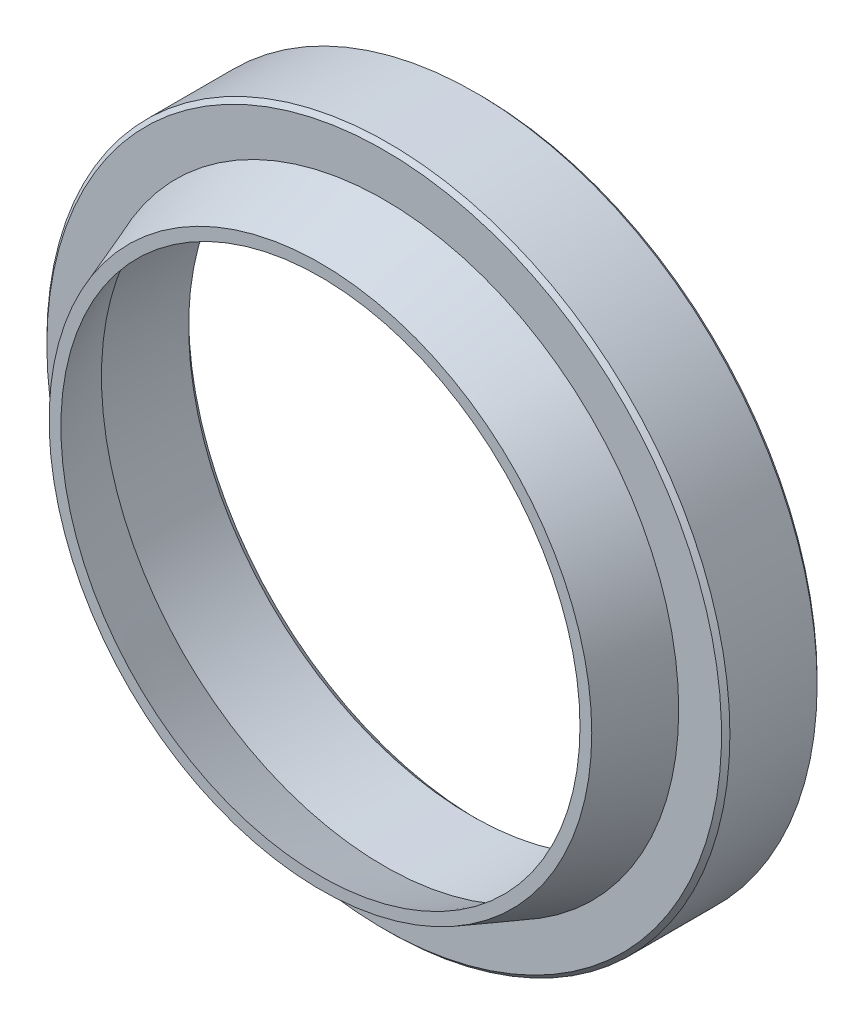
ISO-10303-21;
HEADER;
FILE_DESCRIPTION(('STEP AP214'),'2;1');
FILE_NAME('part.step','',(''),(''),'','','');
FILE_SCHEMA(('AUTOMOTIVE_DESIGN { 1 0 10303 214 1 1 1 1 }'));
ENDSEC;
DATA;
#1=APPLICATION_CONTEXT('core data for automotive mechanical design processes');
#2=APPLICATION_PROTOCOL_DEFINITION('international standard','automotive_design',2000,#1);
#3=PRODUCT_CONTEXT('',#1,'mechanical');
#4=PRODUCT('Part','Part','',(#3));
#5=PRODUCT_RELATED_PRODUCT_CATEGORY('part','',(#4));
#6=PRODUCT_DEFINITION_FORMATION('','',#4);
#7=PRODUCT_DEFINITION_CONTEXT('part definition',#1,'design');
#8=PRODUCT_DEFINITION('design','',#6,#7);
#9=PRODUCT_DEFINITION_SHAPE('','',#8);
#10=(LENGTH_UNIT() NAMED_UNIT(*) SI_UNIT(.MILLI.,.METRE.));
#11=(NAMED_UNIT(*) PLANE_ANGLE_UNIT() SI_UNIT($,.RADIAN.));
#12=(NAMED_UNIT(*) SI_UNIT($,.STERADIAN.) SOLID_ANGLE_UNIT());
#13=UNCERTAINTY_MEASURE_WITH_UNIT(LENGTH_MEASURE(1.E-05),#10,'distance_accuracy_value','');
#14=(GEOMETRIC_REPRESENTATION_CONTEXT(3) GLOBAL_UNCERTAINTY_ASSIGNED_CONTEXT((#13)) GLOBAL_UNIT_ASSIGNED_CONTEXT((#10,
#11,#12)) REPRESENTATION_CONTEXT('',''));
#15=CARTESIAN_POINT('',(0.,0.,0.));
#16=DIRECTION('',(0.,0.,1.));
#17=DIRECTION('',(1.,0.,0.));
#18=AXIS2_PLACEMENT_3D('',#15,#16,#17);
#19=CARTESIAN_POINT('',(-20.7,0.,-11.6666666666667));
#20=DIRECTION('',(0.,0.,1.));
#21=DIRECTION('',(1.,0.,0.));
#22=AXIS2_PLACEMENT_3D('',#19,#20,#21);
#23=PLANE('',#22);
#24=CARTESIAN_POINT('',(0.,0.,-11.6666666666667));
#25=DIRECTION('',(0.,0.,1.));
#26=DIRECTION('',(1.,0.,0.));
#27=AXIS2_PLACEMENT_3D('',#24,#25,#26);
#28=CIRCLE('',#27,24.6928571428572);
#29=CARTESIAN_POINT('',(24.6928571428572,0.,-11.6666666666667));
#30=VERTEX_POINT('',#29);
#31=EDGE_CURVE('E10',#30,#30,#28,.F.);
#32=ORIENTED_EDGE('',*,*,#31,.T.);
#33=EDGE_LOOP('',(#32));
#34=FACE_BOUND('',#33,.T.);
#35=CARTESIAN_POINT('',(0.,0.,-11.6666666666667));
#36=DIRECTION('',(0.,0.,1.));
#37=DIRECTION('',(1.,0.,0.));
#38=AXIS2_PLACEMENT_3D('',#35,#36,#37);
#39=CIRCLE('',#38,21.3142857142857);
#40=CARTESIAN_POINT('',(21.3142857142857,0.,-11.6666666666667));
#41=VERTEX_POINT('',#40);
#42=EDGE_CURVE('E53',#41,#41,#39,.T.);
#43=ORIENTED_EDGE('',*,*,#42,.T.);
#44=EDGE_LOOP('',(#43));
#45=FACE_BOUND('',#44,.T.);
#46=ADVANCED_FACE('F30',(#34,#45),#23,.F.);
#47=CARTESIAN_POINT('',(0.,0.,4.67971075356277));
#48=DIRECTION('',(0.,0.,1.));
#49=DIRECTION('',(1.,0.,0.));
#50=AXIS2_PLACEMENT_3D('',#47,#48,#49);
#51=CYLINDRICAL_SURFACE('',#50,25.);
#52=CARTESIAN_POINT('',(0.,0.,-4.97380952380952));
#53=DIRECTION('',(0.,0.,-1.));
#54=DIRECTION('',(-1.,0.,0.));
#55=AXIS2_PLACEMENT_3D('',#52,#53,#54);
#56=CIRCLE('',#55,25.);
#57=CARTESIAN_POINT('',(-25.,0.,-4.97380952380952));
#58=VERTEX_POINT('',#57);
#59=EDGE_CURVE('E37',#58,#58,#56,.T.);
#60=ORIENTED_EDGE('',*,*,#59,.T.);
#61=EDGE_LOOP('',(#60));
#62=FACE_BOUND('',#61,.T.);
#63=CARTESIAN_POINT('',(0.,0.,-11.3595238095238));
#64=DIRECTION('',(0.,0.,1.));
#65=DIRECTION('',(1.,0.,0.));
#66=AXIS2_PLACEMENT_3D('',#63,#64,#65);
#67=CIRCLE('',#66,25.);
#68=CARTESIAN_POINT('',(25.,0.,-11.3595238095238));
#69=VERTEX_POINT('',#68);
#70=EDGE_CURVE('E41',#69,#69,#67,.T.);
#71=ORIENTED_EDGE('',*,*,#70,.T.);
#72=EDGE_LOOP('',(#71));
#73=FACE_BOUND('',#72,.T.);
#74=ADVANCED_FACE('F91',(#62,#73),#51,.T.);
#75=CARTESIAN_POINT('',(-21.56,0.,-4.66666666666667));
#76=DIRECTION('',(0.,0.,-1.));
#77=DIRECTION('',(-1.,0.,0.));
#78=AXIS2_PLACEMENT_3D('',#75,#76,#77);
#79=PLANE('',#78);
#80=CARTESIAN_POINT('',(0.,0.,-4.66666666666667));
#81=DIRECTION('',(0.,0.,-1.));
#82=DIRECTION('',(-1.,0.,0.));
#83=AXIS2_PLACEMENT_3D('',#80,#81,#82);
#84=CIRCLE('',#83,24.6928571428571);
#85=CARTESIAN_POINT('',(-24.6928571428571,0.,-4.66666666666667));
#86=VERTEX_POINT('',#85);
#87=EDGE_CURVE('E45',#86,#86,#84,.F.);
#88=ORIENTED_EDGE('',*,*,#87,.T.);
#89=EDGE_LOOP('',(#88));
#90=FACE_BOUND('',#89,.T.);
#91=CARTESIAN_POINT('',(0.,0.,-4.66666666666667));
#92=DIRECTION('',(0.,0.,1.));
#93=DIRECTION('',(1.,0.,0.));
#94=AXIS2_PLACEMENT_3D('',#91,#92,#93);
#95=CIRCLE('',#94,21.56);
#96=CARTESIAN_POINT('',(21.56,0.,-4.66666666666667));
#97=VERTEX_POINT('',#96);
#98=EDGE_CURVE('E56',#97,#97,#95,.T.);
#99=ORIENTED_EDGE('',*,*,#98,.F.);
#100=EDGE_LOOP('',(#99));
#101=FACE_BOUND('',#100,.T.);
#102=ADVANCED_FACE('F86',(#90,#101),#79,.F.);
#103=CARTESIAN_POINT('',(0.,0.,-4.66666666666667));
#104=DIRECTION('',(0.,0.,-1.));
#105=DIRECTION('',(-1.,0.,0.));
#106=AXIS2_PLACEMENT_3D('',#103,#104,#105);
#107=CONICAL_SURFACE('',#106,21.56,0.349065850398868);
#108=CARTESIAN_POINT('',(0.,0.,0.));
#109=DIRECTION('',(0.,0.,1.));
#110=DIRECTION('',(1.,0.,0.));
#111=AXIS2_PLACEMENT_3D('',#108,#109,#110);
#112=CIRCLE('',#111,19.8614722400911);
#113=CARTESIAN_POINT('',(19.8614722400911,0.,0.));
#114=VERTEX_POINT('',#113);
#115=EDGE_CURVE('E59',#114,#114,#112,.T.);
#116=ORIENTED_EDGE('',*,*,#115,.F.);
#117=EDGE_LOOP('',(#116));
#118=FACE_BOUND('',#117,.T.);
#119=ORIENTED_EDGE('',*,*,#98,.T.);
#120=EDGE_LOOP('',(#119));
#121=FACE_BOUND('',#120,.T.);
#122=ADVANCED_FACE('F80',(#118,#121),#107,.T.);
#123=CARTESIAN_POINT('',(-19.,0.,0.));
#124=DIRECTION('',(0.,0.,-1.));
#125=DIRECTION('',(-1.,0.,0.));
#126=AXIS2_PLACEMENT_3D('',#123,#124,#125);
#127=PLANE('',#126);
#128=CARTESIAN_POINT('',(0.,0.,0.));
#129=DIRECTION('',(0.,0.,1.));
#130=DIRECTION('',(1.,0.,0.));
#131=AXIS2_PLACEMENT_3D('',#128,#129,#130);
#132=CIRCLE('',#131,19.);
#133=CARTESIAN_POINT('',(19.,0.,0.));
#134=VERTEX_POINT('',#133);
#135=EDGE_CURVE('E62',#134,#134,#132,.T.);
#136=ORIENTED_EDGE('',*,*,#135,.F.);
#137=EDGE_LOOP('',(#136));
#138=FACE_BOUND('',#137,.T.);
#139=ORIENTED_EDGE('',*,*,#115,.T.);
#140=EDGE_LOOP('',(#139));
#141=FACE_BOUND('',#140,.T.);
#142=ADVANCED_FACE('F74',(#138,#141),#127,.F.);
#143=CARTESIAN_POINT('',(0.,0.,0.));
#144=DIRECTION('',(0.,0.,-1.));
#145=DIRECTION('',(-1.,0.,0.));
#146=AXIS2_PLACEMENT_3D('',#143,#144,#145);
#147=CONICAL_SURFACE('',#146,19.,0.349065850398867);
#148=CARTESIAN_POINT('',(0.,0.,-4.67071161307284));
#149=DIRECTION('',(0.,0.,1.));
#150=DIRECTION('',(1.,0.,0.));
#151=AXIS2_PLACEMENT_3D('',#148,#149,#150);
#152=CIRCLE('',#151,20.7);
#153=CARTESIAN_POINT('',(20.7,0.,-4.67071161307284));
#154=VERTEX_POINT('',#153);
#155=EDGE_CURVE('E65',#154,#154,#152,.T.);
#156=ORIENTED_EDGE('',*,*,#155,.F.);
#157=EDGE_LOOP('',(#156));
#158=FACE_BOUND('',#157,.T.);
#159=ORIENTED_EDGE('',*,*,#135,.T.);
#160=EDGE_LOOP('',(#159));
#161=FACE_BOUND('',#160,.T.);
#162=ADVANCED_FACE('F71',(#158,#161),#147,.F.);
#163=CARTESIAN_POINT('',(0.,0.,4.67971075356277));
#164=DIRECTION('',(0.,0.,1.));
#165=DIRECTION('',(1.,0.,0.));
#166=AXIS2_PLACEMENT_3D('',#163,#164,#165);
#167=CYLINDRICAL_SURFACE('',#166,20.7);
#168=CARTESIAN_POINT('',(0.,0.,-11.052380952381));
#169=DIRECTION('',(0.,0.,1.));
#170=DIRECTION('',(1.,0.,0.));
#171=AXIS2_PLACEMENT_3D('',#168,#169,#170);
#172=CIRCLE('',#171,20.7);
#173=CARTESIAN_POINT('',(20.7,0.,-11.052380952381));
#174=VERTEX_POINT('',#173);
#175=EDGE_CURVE('E50',#174,#174,#172,.F.);
#176=ORIENTED_EDGE('',*,*,#175,.T.);
#177=EDGE_LOOP('',(#176));
#178=FACE_BOUND('',#177,.T.);
#179=ORIENTED_EDGE('',*,*,#155,.T.);
#180=EDGE_LOOP('',(#179));
#181=FACE_BOUND('',#180,.T.);
#182=ADVANCED_FACE('F69',(#178,#181),#167,.F.);
#183=CARTESIAN_POINT('',(0.,0.,-11.6666666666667));
#184=DIRECTION('',(0.,0.,-1.));
#185=DIRECTION('',(-1.,0.,0.));
#186=AXIS2_PLACEMENT_3D('',#183,#184,#185);
#187=CONICAL_SURFACE('',#186,21.3142857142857,0.785398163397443);
#188=ORIENTED_EDGE('',*,*,#175,.F.);
#189=EDGE_LOOP('',(#188));
#190=FACE_BOUND('',#189,.T.);
#191=ORIENTED_EDGE('',*,*,#42,.F.);
#192=EDGE_LOOP('',(#191));
#193=FACE_BOUND('',#192,.T.);
#194=ADVANCED_FACE('F104',(#190,#193),#187,.F.);
#195=CARTESIAN_POINT('',(0.,0.,-4.66666666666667));
#196=DIRECTION('',(0.,0.,-1.));
#197=DIRECTION('',(-1.,0.,0.));
#198=AXIS2_PLACEMENT_3D('',#195,#196,#197);
#199=CONICAL_SURFACE('',#198,24.6928571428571,0.785398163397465);
#200=ORIENTED_EDGE('',*,*,#59,.F.);
#201=EDGE_LOOP('',(#200));
#202=FACE_BOUND('',#201,.T.);
#203=ORIENTED_EDGE('',*,*,#87,.F.);
#204=EDGE_LOOP('',(#203));
#205=FACE_BOUND('',#204,.T.);
#206=ADVANCED_FACE('F106',(#202,#205),#199,.T.);
#207=CARTESIAN_POINT('',(0.,0.,-11.3595238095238));
#208=DIRECTION('',(0.,0.,1.));
#209=DIRECTION('',(1.,0.,0.));
#210=AXIS2_PLACEMENT_3D('',#207,#208,#209);
#211=CONICAL_SURFACE('',#210,25.,0.785398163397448);
#212=ORIENTED_EDGE('',*,*,#31,.F.);
#213=EDGE_LOOP('',(#212));
#214=FACE_BOUND('',#213,.T.);
#215=ORIENTED_EDGE('',*,*,#70,.F.);
#216=EDGE_LOOP('',(#215));
#217=FACE_BOUND('',#216,.T.);
#218=ADVANCED_FACE('F32',(#214,#217),#211,.T.);
#219=CLOSED_SHELL('',(#46,#74,#102,#122,#142,#162,#182,#194,#206,#218));
#220=MANIFOLD_SOLID_BREP('B2',#219);
#221=ADVANCED_BREP_SHAPE_REPRESENTATION('',(#18,#220),#14);
#222=SHAPE_DEFINITION_REPRESENTATION(#9,#221);
ENDSEC;
END-ISO-10303-21;
